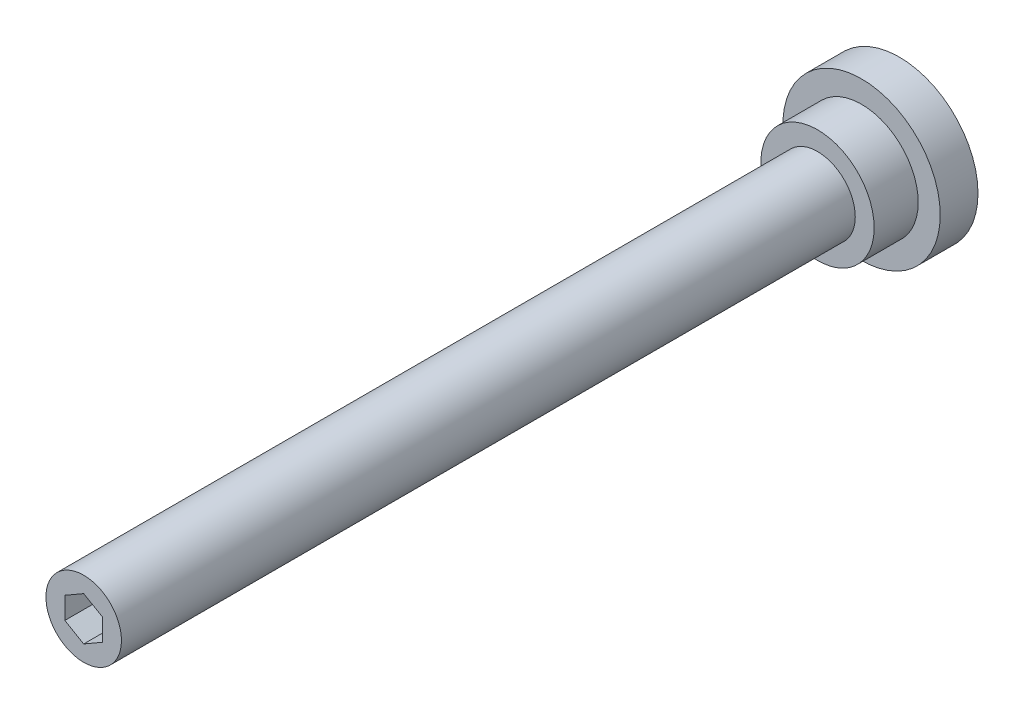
ISO-10303-21;
HEADER;
FILE_DESCRIPTION(('STEP AP214'),'2;1');
FILE_NAME('part.step','',(''),(''),'','','');
FILE_SCHEMA(('AUTOMOTIVE_DESIGN { 1 0 10303 214 1 1 1 1 }'));
ENDSEC;
DATA;
#1=APPLICATION_CONTEXT('core data for automotive mechanical design processes');
#2=APPLICATION_PROTOCOL_DEFINITION('international standard','automotive_design',2000,#1);
#3=PRODUCT_CONTEXT('',#1,'mechanical');
#4=PRODUCT('Part','Part','',(#3));
#5=PRODUCT_RELATED_PRODUCT_CATEGORY('part','',(#4));
#6=PRODUCT_DEFINITION_FORMATION('','',#4);
#7=PRODUCT_DEFINITION_CONTEXT('part definition',#1,'design');
#8=PRODUCT_DEFINITION('design','',#6,#7);
#9=PRODUCT_DEFINITION_SHAPE('','',#8);
#10=(LENGTH_UNIT() NAMED_UNIT(*) SI_UNIT(.MILLI.,.METRE.));
#11=(NAMED_UNIT(*) PLANE_ANGLE_UNIT() SI_UNIT($,.RADIAN.));
#12=(NAMED_UNIT(*) SI_UNIT($,.STERADIAN.) SOLID_ANGLE_UNIT());
#13=UNCERTAINTY_MEASURE_WITH_UNIT(LENGTH_MEASURE(1.E-05),#10,'distance_accuracy_value','');
#14=(GEOMETRIC_REPRESENTATION_CONTEXT(3) GLOBAL_UNCERTAINTY_ASSIGNED_CONTEXT((#13)) GLOBAL_UNIT_ASSIGNED_CONTEXT((#10,
#11,#12)) REPRESENTATION_CONTEXT('',''));
#15=CARTESIAN_POINT('',(0.,0.,0.));
#16=DIRECTION('',(0.,0.,1.));
#17=DIRECTION('',(1.,0.,0.));
#18=AXIS2_PLACEMENT_3D('',#15,#16,#17);
#19=CARTESIAN_POINT('',(0.,0.,129.6));
#20=DIRECTION('',(0.,0.,1.));
#21=DIRECTION('',(1.,0.,0.));
#22=AXIS2_PLACEMENT_3D('',#19,#20,#21);
#23=PLANE('',#22);
#24=DIRECTION('',(-0.866025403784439,0.5,0.));
#25=VECTOR('',#24,1.);
#26=CARTESIAN_POINT('',(3.,1.73205080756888,129.6));
#27=LINE('',#26,#25);
#28=CARTESIAN_POINT('',(3.,1.73205080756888,129.6));
#29=VERTEX_POINT('',#28);
#30=CARTESIAN_POINT('',(0.,3.46410161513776,129.6));
#31=VERTEX_POINT('',#30);
#32=EDGE_CURVE('E28',#29,#31,#27,.T.);
#33=ORIENTED_EDGE('',*,*,#32,.F.);
#34=DIRECTION('',(0.,1.,0.));
#35=VECTOR('',#34,1.);
#36=CARTESIAN_POINT('',(3.,-1.73205080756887,129.6));
#37=LINE('',#36,#35);
#38=CARTESIAN_POINT('',(3.,-1.73205080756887,129.6));
#39=VERTEX_POINT('',#38);
#40=EDGE_CURVE('E111',#39,#29,#37,.T.);
#41=ORIENTED_EDGE('',*,*,#40,.F.);
#42=DIRECTION('',(0.866025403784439,0.5,0.));
#43=VECTOR('',#42,1.);
#44=CARTESIAN_POINT('',(0.,-3.46410161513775,129.6));
#45=LINE('',#44,#43);
#46=CARTESIAN_POINT('',(0.,-3.46410161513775,129.6));
#47=VERTEX_POINT('',#46);
#48=EDGE_CURVE('E109',#47,#39,#45,.T.);
#49=ORIENTED_EDGE('',*,*,#48,.F.);
#50=DIRECTION('',(0.866025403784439,-0.5,0.));
#51=VECTOR('',#50,1.);
#52=CARTESIAN_POINT('',(-3.,-1.73205080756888,129.6));
#53=LINE('',#52,#51);
#54=CARTESIAN_POINT('',(-3.,-1.73205080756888,129.6));
#55=VERTEX_POINT('',#54);
#56=EDGE_CURVE('E76',#55,#47,#53,.T.);
#57=ORIENTED_EDGE('',*,*,#56,.F.);
#58=DIRECTION('',(0.,-1.,0.));
#59=VECTOR('',#58,1.);
#60=CARTESIAN_POINT('',(-3.,1.73205080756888,129.6));
#61=LINE('',#60,#59);
#62=CARTESIAN_POINT('',(-3.,1.73205080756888,129.6));
#63=VERTEX_POINT('',#62);
#64=EDGE_CURVE('E105',#63,#55,#61,.T.);
#65=ORIENTED_EDGE('',*,*,#64,.F.);
#66=DIRECTION('',(-0.866025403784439,-0.5,0.));
#67=VECTOR('',#66,1.);
#68=CARTESIAN_POINT('',(0.,3.46410161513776,129.6));
#69=LINE('',#68,#67);
#70=EDGE_CURVE('E102',#31,#63,#69,.T.);
#71=ORIENTED_EDGE('',*,*,#70,.F.);
#72=EDGE_LOOP('',(#33,#41,#49,#57,#65,#71));
#73=FACE_BOUND('',#72,.T.);
#74=CARTESIAN_POINT('',(0.,0.,129.6));
#75=DIRECTION('',(0.,0.,1.));
#76=DIRECTION('',(1.,0.,0.));
#77=AXIS2_PLACEMENT_3D('',#74,#75,#76);
#78=CIRCLE('',#77,6.);
#79=CARTESIAN_POINT('',(6.,0.,129.6));
#80=VERTEX_POINT('',#79);
#81=EDGE_CURVE('E9',#80,#80,#78,.T.);
#82=ORIENTED_EDGE('',*,*,#81,.T.);
#83=EDGE_LOOP('',(#82));
#84=FACE_BOUND('',#83,.T.);
#85=ADVANCED_FACE('F14',(#73,#84),#23,.T.);
#86=CARTESIAN_POINT('',(0.,0.,30.));
#87=DIRECTION('',(0.,0.,1.));
#88=DIRECTION('',(1.,0.,0.));
#89=AXIS2_PLACEMENT_3D('',#86,#87,#88);
#90=CYLINDRICAL_SURFACE('',#89,6.);
#91=CARTESIAN_POINT('',(0.,0.,13.));
#92=DIRECTION('',(0.,0.,1.));
#93=DIRECTION('',(1.,0.,0.));
#94=AXIS2_PLACEMENT_3D('',#91,#92,#93);
#95=CIRCLE('',#94,6.);
#96=CARTESIAN_POINT('',(6.,0.,13.));
#97=VERTEX_POINT('',#96);
#98=EDGE_CURVE('E21',#97,#97,#95,.T.);
#99=ORIENTED_EDGE('',*,*,#98,.T.);
#100=EDGE_LOOP('',(#99));
#101=FACE_BOUND('',#100,.T.);
#102=ORIENTED_EDGE('',*,*,#81,.F.);
#103=EDGE_LOOP('',(#102));
#104=FACE_BOUND('',#103,.T.);
#105=ADVANCED_FACE('F134',(#101,#104),#90,.T.);
#106=CARTESIAN_POINT('',(-6.,0.,13.));
#107=DIRECTION('',(0.,0.,1.));
#108=DIRECTION('',(1.,0.,0.));
#109=AXIS2_PLACEMENT_3D('',#106,#107,#108);
#110=PLANE('',#109);
#111=CARTESIAN_POINT('',(0.,0.,13.));
#112=DIRECTION('',(0.,0.,1.));
#113=DIRECTION('',(1.,0.,0.));
#114=AXIS2_PLACEMENT_3D('',#111,#112,#113);
#115=CIRCLE('',#114,9.);
#116=CARTESIAN_POINT('',(9.,0.,13.));
#117=VERTEX_POINT('',#116);
#118=EDGE_CURVE('E129',#117,#117,#115,.T.);
#119=ORIENTED_EDGE('',*,*,#118,.T.);
#120=EDGE_LOOP('',(#119));
#121=FACE_BOUND('',#120,.T.);
#122=ORIENTED_EDGE('',*,*,#98,.F.);
#123=EDGE_LOOP('',(#122));
#124=FACE_BOUND('',#123,.T.);
#125=ADVANCED_FACE('F137',(#121,#124),#110,.T.);
#126=CARTESIAN_POINT('',(0.,0.,30.));
#127=DIRECTION('',(0.,0.,1.));
#128=DIRECTION('',(1.,0.,0.));
#129=AXIS2_PLACEMENT_3D('',#126,#127,#128);
#130=CYLINDRICAL_SURFACE('',#129,9.);
#131=CARTESIAN_POINT('',(0.,0.,6.));
#132=DIRECTION('',(0.,0.,1.));
#133=DIRECTION('',(1.,0.,0.));
#134=AXIS2_PLACEMENT_3D('',#131,#132,#133);
#135=CIRCLE('',#134,9.);
#136=CARTESIAN_POINT('',(9.,0.,6.));
#137=VERTEX_POINT('',#136);
#138=EDGE_CURVE('E126',#137,#137,#135,.T.);
#139=ORIENTED_EDGE('',*,*,#138,.T.);
#140=EDGE_LOOP('',(#139));
#141=FACE_BOUND('',#140,.T.);
#142=ORIENTED_EDGE('',*,*,#118,.F.);
#143=EDGE_LOOP('',(#142));
#144=FACE_BOUND('',#143,.T.);
#145=ADVANCED_FACE('F139',(#141,#144),#130,.T.);
#146=CARTESIAN_POINT('',(-9.,0.,6.));
#147=DIRECTION('',(0.,0.,1.));
#148=DIRECTION('',(1.,0.,0.));
#149=AXIS2_PLACEMENT_3D('',#146,#147,#148);
#150=PLANE('',#149);
#151=CARTESIAN_POINT('',(0.,0.,6.));
#152=DIRECTION('',(0.,0.,1.));
#153=DIRECTION('',(1.,0.,0.));
#154=AXIS2_PLACEMENT_3D('',#151,#152,#153);
#155=CIRCLE('',#154,12.5);
#156=CARTESIAN_POINT('',(12.5,0.,6.));
#157=VERTEX_POINT('',#156);
#158=EDGE_CURVE('E123',#157,#157,#155,.T.);
#159=ORIENTED_EDGE('',*,*,#158,.T.);
#160=EDGE_LOOP('',(#159));
#161=FACE_BOUND('',#160,.T.);
#162=ORIENTED_EDGE('',*,*,#138,.F.);
#163=EDGE_LOOP('',(#162));
#164=FACE_BOUND('',#163,.T.);
#165=ADVANCED_FACE('F147',(#161,#164),#150,.T.);
#166=CARTESIAN_POINT('',(0.,0.,30.));
#167=DIRECTION('',(0.,0.,1.));
#168=DIRECTION('',(1.,0.,0.));
#169=AXIS2_PLACEMENT_3D('',#166,#167,#168);
#170=CYLINDRICAL_SURFACE('',#169,12.5);
#171=CARTESIAN_POINT('',(0.,0.,0.));
#172=DIRECTION('',(0.,0.,1.));
#173=DIRECTION('',(1.,0.,0.));
#174=AXIS2_PLACEMENT_3D('',#171,#172,#173);
#175=CIRCLE('',#174,12.5);
#176=CARTESIAN_POINT('',(12.5,0.,0.));
#177=VERTEX_POINT('',#176);
#178=EDGE_CURVE('E115',#177,#177,#175,.T.);
#179=ORIENTED_EDGE('',*,*,#178,.T.);
#180=EDGE_LOOP('',(#179));
#181=FACE_BOUND('',#180,.T.);
#182=ORIENTED_EDGE('',*,*,#158,.F.);
#183=EDGE_LOOP('',(#182));
#184=FACE_BOUND('',#183,.T.);
#185=ADVANCED_FACE('F172',(#181,#184),#170,.T.);
#186=CARTESIAN_POINT('',(-12.5,0.,0.));
#187=DIRECTION('',(0.,0.,-1.));
#188=DIRECTION('',(-1.,0.,0.));
#189=AXIS2_PLACEMENT_3D('',#186,#187,#188);
#190=PLANE('',#189);
#191=ORIENTED_EDGE('',*,*,#178,.F.);
#192=EDGE_LOOP('',(#191));
#193=FACE_BOUND('',#192,.T.);
#194=ADVANCED_FACE('F165',(#193),#190,.T.);
#195=CARTESIAN_POINT('',(3.,1.73205080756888,124.6));
#196=DIRECTION('',(0.5,0.866025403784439,0.));
#197=DIRECTION('',(-0.866025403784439,0.5,0.));
#198=AXIS2_PLACEMENT_3D('',#195,#196,#197);
#199=PLANE('',#198);
#200=ORIENTED_EDGE('',*,*,#32,.T.);
#201=DIRECTION('',(0.,0.,1.));
#202=VECTOR('',#201,1.);
#203=CARTESIAN_POINT('',(0.,3.46410161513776,124.6));
#204=LINE('',#203,#202);
#205=CARTESIAN_POINT('',(0.,3.46410161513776,124.6));
#206=VERTEX_POINT('',#205);
#207=EDGE_CURVE('E58',#206,#31,#204,.T.);
#208=ORIENTED_EDGE('',*,*,#207,.F.);
#209=DIRECTION('',(-0.866025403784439,0.5,0.));
#210=VECTOR('',#209,1.);
#211=CARTESIAN_POINT('',(3.,1.73205080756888,124.6));
#212=LINE('',#211,#210);
#213=CARTESIAN_POINT('',(3.,1.73205080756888,124.6));
#214=VERTEX_POINT('',#213);
#215=EDGE_CURVE('E113',#214,#206,#212,.T.);
#216=ORIENTED_EDGE('',*,*,#215,.F.);
#217=DIRECTION('',(0.,0.,1.));
#218=VECTOR('',#217,1.);
#219=CARTESIAN_POINT('',(3.,1.73205080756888,124.6));
#220=LINE('',#219,#218);
#221=EDGE_CURVE('E36',#214,#29,#220,.T.);
#222=ORIENTED_EDGE('',*,*,#221,.T.);
#223=EDGE_LOOP('',(#200,#208,#216,#222));
#224=FACE_BOUND('',#223,.T.);
#225=ADVANCED_FACE('F162',(#224),#199,.F.);
#226=CARTESIAN_POINT('',(3.,-1.73205080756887,124.6));
#227=DIRECTION('',(1.,0.,0.));
#228=DIRECTION('',(0.,0.,-1.));
#229=AXIS2_PLACEMENT_3D('',#226,#227,#228);
#230=PLANE('',#229);
#231=ORIENTED_EDGE('',*,*,#40,.T.);
#232=ORIENTED_EDGE('',*,*,#221,.F.);
#233=DIRECTION('',(0.,1.,0.));
#234=VECTOR('',#233,1.);
#235=CARTESIAN_POINT('',(3.,-1.73205080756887,124.6));
#236=LINE('',#235,#234);
#237=CARTESIAN_POINT('',(3.,-1.73205080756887,124.6));
#238=VERTEX_POINT('',#237);
#239=EDGE_CURVE('E88',#238,#214,#236,.T.);
#240=ORIENTED_EDGE('',*,*,#239,.F.);
#241=DIRECTION('',(0.,0.,1.));
#242=VECTOR('',#241,1.);
#243=CARTESIAN_POINT('',(3.,-1.73205080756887,124.6));
#244=LINE('',#243,#242);
#245=EDGE_CURVE('E80',#238,#39,#244,.T.);
#246=ORIENTED_EDGE('',*,*,#245,.T.);
#247=EDGE_LOOP('',(#231,#232,#240,#246));
#248=FACE_BOUND('',#247,.T.);
#249=ADVANCED_FACE('F164',(#248),#230,.F.);
#250=CARTESIAN_POINT('',(0.,-3.46410161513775,124.6));
#251=DIRECTION('',(0.5,-0.866025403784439,0.));
#252=DIRECTION('',(0.866025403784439,0.5,0.));
#253=AXIS2_PLACEMENT_3D('',#250,#251,#252);
#254=PLANE('',#253);
#255=ORIENTED_EDGE('',*,*,#48,.T.);
#256=ORIENTED_EDGE('',*,*,#245,.F.);
#257=DIRECTION('',(0.866025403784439,0.5,0.));
#258=VECTOR('',#257,1.);
#259=CARTESIAN_POINT('',(0.,-3.46410161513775,124.6));
#260=LINE('',#259,#258);
#261=CARTESIAN_POINT('',(0.,-3.46410161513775,124.6));
#262=VERTEX_POINT('',#261);
#263=EDGE_CURVE('E84',#262,#238,#260,.T.);
#264=ORIENTED_EDGE('',*,*,#263,.F.);
#265=DIRECTION('',(0.,0.,1.));
#266=VECTOR('',#265,1.);
#267=CARTESIAN_POINT('',(0.,-3.46410161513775,124.6));
#268=LINE('',#267,#266);
#269=EDGE_CURVE('E69',#262,#47,#268,.T.);
#270=ORIENTED_EDGE('',*,*,#269,.T.);
#271=EDGE_LOOP('',(#255,#256,#264,#270));
#272=FACE_BOUND('',#271,.T.);
#273=ADVANCED_FACE('F85',(#272),#254,.F.);
#274=CARTESIAN_POINT('',(-3.,-1.73205080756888,124.6));
#275=DIRECTION('',(-0.5,-0.866025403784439,0.));
#276=DIRECTION('',(0.866025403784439,-0.5,0.));
#277=AXIS2_PLACEMENT_3D('',#274,#275,#276);
#278=PLANE('',#277);
#279=ORIENTED_EDGE('',*,*,#56,.T.);
#280=ORIENTED_EDGE('',*,*,#269,.F.);
#281=DIRECTION('',(0.866025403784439,-0.5,0.));
#282=VECTOR('',#281,1.);
#283=CARTESIAN_POINT('',(-3.,-1.73205080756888,124.6));
#284=LINE('',#283,#282);
#285=CARTESIAN_POINT('',(-3.,-1.73205080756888,124.6));
#286=VERTEX_POINT('',#285);
#287=EDGE_CURVE('E73',#286,#262,#284,.T.);
#288=ORIENTED_EDGE('',*,*,#287,.F.);
#289=DIRECTION('',(0.,0.,1.));
#290=VECTOR('',#289,1.);
#291=CARTESIAN_POINT('',(-3.,-1.73205080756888,124.6));
#292=LINE('',#291,#290);
#293=EDGE_CURVE('E81',#286,#55,#292,.T.);
#294=ORIENTED_EDGE('',*,*,#293,.T.);
#295=EDGE_LOOP('',(#279,#280,#288,#294));
#296=FACE_BOUND('',#295,.T.);
#297=ADVANCED_FACE('F71',(#296),#278,.F.);
#298=CARTESIAN_POINT('',(-3.,1.73205080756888,124.6));
#299=DIRECTION('',(-1.,0.,0.));
#300=DIRECTION('',(0.,-1.,0.));
#301=AXIS2_PLACEMENT_3D('',#298,#299,#300);
#302=PLANE('',#301);
#303=ORIENTED_EDGE('',*,*,#64,.T.);
#304=ORIENTED_EDGE('',*,*,#293,.F.);
#305=DIRECTION('',(0.,-1.,0.));
#306=VECTOR('',#305,1.);
#307=CARTESIAN_POINT('',(-3.,1.73205080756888,124.6));
#308=LINE('',#307,#306);
#309=CARTESIAN_POINT('',(-3.,1.73205080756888,124.6));
#310=VERTEX_POINT('',#309);
#311=EDGE_CURVE('E94',#310,#286,#308,.T.);
#312=ORIENTED_EDGE('',*,*,#311,.F.);
#313=DIRECTION('',(0.,0.,1.));
#314=VECTOR('',#313,1.);
#315=CARTESIAN_POINT('',(-3.,1.73205080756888,124.6));
#316=LINE('',#315,#314);
#317=EDGE_CURVE('E118',#310,#63,#316,.T.);
#318=ORIENTED_EDGE('',*,*,#317,.T.);
#319=EDGE_LOOP('',(#303,#304,#312,#318));
#320=FACE_BOUND('',#319,.T.);
#321=ADVANCED_FACE('F237',(#320),#302,.F.);
#322=CARTESIAN_POINT('',(0.,3.46410161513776,124.6));
#323=DIRECTION('',(-0.5,0.866025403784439,0.));
#324=DIRECTION('',(-0.866025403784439,-0.5,0.));
#325=AXIS2_PLACEMENT_3D('',#322,#323,#324);
#326=PLANE('',#325);
#327=ORIENTED_EDGE('',*,*,#70,.T.);
#328=ORIENTED_EDGE('',*,*,#317,.F.);
#329=DIRECTION('',(-0.866025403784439,-0.5,0.));
#330=VECTOR('',#329,1.);
#331=CARTESIAN_POINT('',(0.,3.46410161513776,124.6));
#332=LINE('',#331,#330);
#333=EDGE_CURVE('E96',#206,#310,#332,.T.);
#334=ORIENTED_EDGE('',*,*,#333,.F.);
#335=ORIENTED_EDGE('',*,*,#207,.T.);
#336=EDGE_LOOP('',(#327,#328,#334,#335));
#337=FACE_BOUND('',#336,.T.);
#338=ADVANCED_FACE('F160',(#337),#326,.F.);
#339=CARTESIAN_POINT('',(0.,3.46410161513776,124.6));
#340=DIRECTION('',(0.,0.,1.));
#341=DIRECTION('',(1.,0.,0.));
#342=AXIS2_PLACEMENT_3D('',#339,#340,#341);
#343=PLANE('',#342);
#344=ORIENTED_EDGE('',*,*,#215,.T.);
#345=ORIENTED_EDGE('',*,*,#333,.T.);
#346=ORIENTED_EDGE('',*,*,#311,.T.);
#347=ORIENTED_EDGE('',*,*,#287,.T.);
#348=ORIENTED_EDGE('',*,*,#263,.T.);
#349=ORIENTED_EDGE('',*,*,#239,.T.);
#350=EDGE_LOOP('',(#344,#345,#346,#347,#348,#349));
#351=FACE_BOUND('',#350,.T.);
#352=ADVANCED_FACE('F91',(#351),#343,.T.);
#353=CLOSED_SHELL('',(#85,#105,#125,#145,#165,#185,#194,#225,#249,#273,#297,#321,#338,#352));
#354=MANIFOLD_SOLID_BREP('B1',#353);
#355=ADVANCED_BREP_SHAPE_REPRESENTATION('',(#18,#354),#14);
#356=SHAPE_DEFINITION_REPRESENTATION(#9,#355);
ENDSEC;
END-ISO-10303-21;
